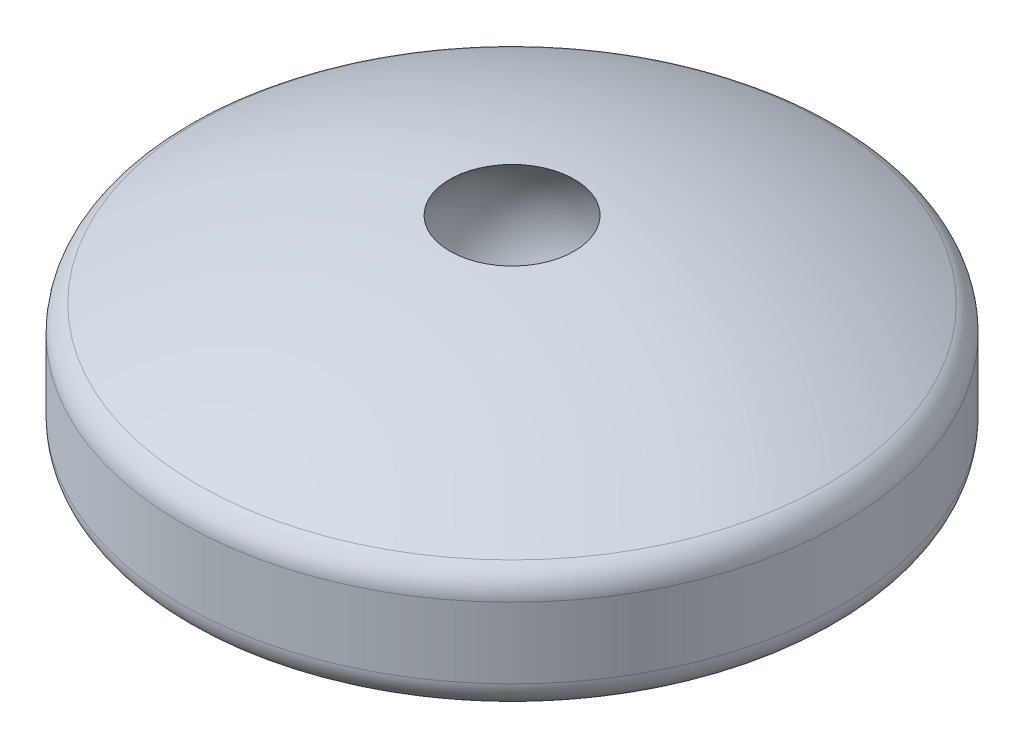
ISO-10303-21;
HEADER;
FILE_DESCRIPTION(('STEP AP214'),'2;1');
FILE_NAME('part.step','',(''),(''),'','','');
FILE_SCHEMA(('AUTOMOTIVE_DESIGN { 1 0 10303 214 1 1 1 1 }'));
ENDSEC;
DATA;
#1=APPLICATION_CONTEXT('core data for automotive mechanical design processes');
#2=APPLICATION_PROTOCOL_DEFINITION('international standard','automotive_design',2000,#1);
#3=PRODUCT_CONTEXT('',#1,'mechanical');
#4=PRODUCT('Part','Part','',(#3));
#5=PRODUCT_RELATED_PRODUCT_CATEGORY('part','',(#4));
#6=PRODUCT_DEFINITION_FORMATION('','',#4);
#7=PRODUCT_DEFINITION_CONTEXT('part definition',#1,'design');
#8=PRODUCT_DEFINITION('design','',#6,#7);
#9=PRODUCT_DEFINITION_SHAPE('','',#8);
#10=(LENGTH_UNIT() NAMED_UNIT(*) SI_UNIT(.MILLI.,.METRE.));
#11=(NAMED_UNIT(*) PLANE_ANGLE_UNIT() SI_UNIT($,.RADIAN.));
#12=(NAMED_UNIT(*) SI_UNIT($,.STERADIAN.) SOLID_ANGLE_UNIT());
#13=UNCERTAINTY_MEASURE_WITH_UNIT(LENGTH_MEASURE(1.E-05),#10,'distance_accuracy_value','');
#14=(GEOMETRIC_REPRESENTATION_CONTEXT(3) GLOBAL_UNCERTAINTY_ASSIGNED_CONTEXT((#13)) GLOBAL_UNIT_ASSIGNED_CONTEXT((#10,
#11,#12)) REPRESENTATION_CONTEXT('',''));
#15=CARTESIAN_POINT('',(0.,0.,0.));
#16=DIRECTION('',(0.,0.,1.));
#17=DIRECTION('',(1.,0.,0.));
#18=AXIS2_PLACEMENT_3D('',#15,#16,#17);
#19=CARTESIAN_POINT('',(0.,0.,0.));
#20=DIRECTION('',(0.,-1.,0.));
#21=DIRECTION('',(0.,0.,-1.));
#22=AXIS2_PLACEMENT_3D('',#19,#20,#21);
#23=PLANE('',#22);
#24=CARTESIAN_POINT('',(0.,0.,0.));
#25=DIRECTION('',(0.,1.,0.));
#26=DIRECTION('',(0.,0.,1.));
#27=AXIS2_PLACEMENT_3D('',#24,#25,#26);
#28=CIRCLE('',#27,20.5);
#29=CARTESIAN_POINT('',(0.,0.,20.5));
#30=VERTEX_POINT('',#29);
#31=EDGE_CURVE('E10',#30,#30,#28,.T.);
#32=ORIENTED_EDGE('',*,*,#31,.F.);
#33=EDGE_LOOP('',(#32));
#34=FACE_BOUND('',#33,.T.);
#35=ADVANCED_FACE('F28',(#34),#23,.T.);
#36=CARTESIAN_POINT('',(0.,2.,0.));
#37=DIRECTION('',(0.,1.,0.));
#38=DIRECTION('',(0.,0.,1.));
#39=AXIS2_PLACEMENT_3D('',#36,#37,#38);
#40=TOROIDAL_SURFACE('',#39,20.5,2.);
#41=ORIENTED_EDGE('',*,*,#31,.T.);
#42=EDGE_LOOP('',(#41));
#43=FACE_BOUND('',#42,.T.);
#44=CARTESIAN_POINT('',(0.,2.,0.));
#45=DIRECTION('',(0.,1.,0.));
#46=DIRECTION('',(0.,0.,1.));
#47=AXIS2_PLACEMENT_3D('',#44,#45,#46);
#48=CIRCLE('',#47,22.5);
#49=CARTESIAN_POINT('',(0.,2.,22.5));
#50=VERTEX_POINT('',#49);
#51=EDGE_CURVE('E35',#50,#50,#48,.T.);
#52=ORIENTED_EDGE('',*,*,#51,.F.);
#53=EDGE_LOOP('',(#52));
#54=FACE_BOUND('',#53,.T.);
#55=ADVANCED_FACE('F66',(#43,#54),#40,.T.);
#56=CARTESIAN_POINT('',(0.,0.,0.));
#57=DIRECTION('',(0.,1.,0.));
#58=DIRECTION('',(0.,0.,1.));
#59=AXIS2_PLACEMENT_3D('',#56,#57,#58);
#60=CYLINDRICAL_SURFACE('',#59,22.5);
#61=ORIENTED_EDGE('',*,*,#51,.T.);
#62=EDGE_LOOP('',(#61));
#63=FACE_BOUND('',#62,.T.);
#64=CARTESIAN_POINT('',(0.,6.82447385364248,0.));
#65=DIRECTION('',(0.,1.,0.));
#66=DIRECTION('',(0.,0.,1.));
#67=AXIS2_PLACEMENT_3D('',#64,#65,#66);
#68=CIRCLE('',#67,22.5);
#69=CARTESIAN_POINT('',(0.,6.82447385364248,22.5));
#70=VERTEX_POINT('',#69);
#71=EDGE_CURVE('E39',#70,#70,#68,.T.);
#72=ORIENTED_EDGE('',*,*,#71,.F.);
#73=EDGE_LOOP('',(#72));
#74=FACE_BOUND('',#73,.T.);
#75=ADVANCED_FACE('F62',(#63,#74),#60,.T.);
#76=CARTESIAN_POINT('',(0.,6.82447385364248,0.));
#77=DIRECTION('',(0.,1.,0.));
#78=DIRECTION('',(0.,0.,1.));
#79=AXIS2_PLACEMENT_3D('',#76,#77,#78);
#80=TOROIDAL_SURFACE('',#79,20.5,2.);
#81=ORIENTED_EDGE('',*,*,#71,.T.);
#82=EDGE_LOOP('',(#81));
#83=FACE_BOUND('',#82,.T.);
#84=CARTESIAN_POINT('',(0.,8.58479681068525,0.));
#85=DIRECTION('',(0.,1.,0.));
#86=DIRECTION('',(0.,0.,1.));
#87=AXIS2_PLACEMENT_3D('',#84,#85,#86);
#88=CIRCLE('',#87,21.4493487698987);
#89=CARTESIAN_POINT('',(21.4493487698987,8.58479681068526,0.));
#90=VERTEX_POINT('',#89);
#91=EDGE_CURVE('E44',#90,#90,#88,.T.);
#92=ORIENTED_EDGE('',*,*,#91,.F.);
#93=EDGE_LOOP('',(#92));
#94=FACE_BOUND('',#93,.T.);
#95=ADVANCED_FACE('F55',(#83,#94),#80,.T.);
#96=CARTESIAN_POINT('',(0.,-31.1875,0.));
#97=DIRECTION('',(0.,1.,0.));
#98=DIRECTION('',(1.,0.,0.));
#99=AXIS2_PLACEMENT_3D('',#96,#97,#98);
#100=SPHERICAL_SURFACE('',#99,45.1875);
#101=CARTESIAN_POINT('',(0.,13.7996943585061,0.));
#102=DIRECTION('',(0.,1.,0.));
#103=DIRECTION('',(-1.,0.,0.));
#104=AXIS2_PLACEMENT_3D('',#101,#102,#103);
#105=CIRCLE('',#104,4.25000000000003);
#106=CARTESIAN_POINT('',(4.25000000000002,13.7996943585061,0.));
#107=VERTEX_POINT('',#106);
#108=EDGE_CURVE('E31',#107,#107,#105,.T.);
#109=CARTESIAN_POINT('',(4.25000000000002,13.7996943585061,0.));
#110=CARTESIAN_POINT('',(4.4376351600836,13.7819682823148,0.));
#111=CARTESIAN_POINT('',(4.62515940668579,13.763068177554,0.));
#112=CARTESIAN_POINT('',(4.99995674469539,13.7229231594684,0.));
#113=CARTESIAN_POINT('',(5.18722983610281,13.7016782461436,0.));
#114=CARTESIAN_POINT('',(5.56149553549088,13.656846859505,0.));
#115=CARTESIAN_POINT('',(5.74848814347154,13.6332603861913,0.));
#116=CARTESIAN_POINT('',(6.12216360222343,13.5837495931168,0.));
#117=CARTESIAN_POINT('',(6.30884645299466,13.557825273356,0.));
#118=CARTESIAN_POINT('',(6.68187316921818,13.503642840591,0.));
#119=CARTESIAN_POINT('',(6.86821703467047,13.4753847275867,0.));
#120=CARTESIAN_POINT('',(7.24053660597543,13.4165391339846,0.));
#121=CARTESIAN_POINT('',(7.4265123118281,13.3859516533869,0.));
#122=CARTESIAN_POINT('',(7.79806644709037,13.322452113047,0.));
#123=CARTESIAN_POINT('',(7.98364487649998,13.2895400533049,0.));
#124=CARTESIAN_POINT('',(8.35437540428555,13.2213965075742,0.));
#125=CARTESIAN_POINT('',(8.53952750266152,13.1861650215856,0.));
#126=CARTESIAN_POINT('',(8.9093763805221,13.1133881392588,0.));
#127=CARTESIAN_POINT('',(9.09407316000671,13.0758427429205,0.));
#128=CARTESIAN_POINT('',(9.46298248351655,12.9984439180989,0.));
#129=CARTESIAN_POINT('',(9.64719502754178,12.9585904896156,0.));
#130=CARTESIAN_POINT('',(10.0151070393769,12.8765818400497,0.));
#131=CARTESIAN_POINT('',(10.1988065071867,12.8344266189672,0.));
#132=CARTESIAN_POINT('',(10.5656636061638,12.7478209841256,0.));
#133=CARTESIAN_POINT('',(10.748821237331,12.7033705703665,0.));
#134=CARTESIAN_POINT('',(11.1145659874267,12.6121815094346,0.));
#135=CARTESIAN_POINT('',(11.2971531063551,12.5654428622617,0.));
#136=CARTESIAN_POINT('',(11.6617282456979,12.4696846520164,0.));
#137=CARTESIAN_POINT('',(11.8437162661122,12.420665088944,0.));
#138=CARTESIAN_POINT('',(12.2070647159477,12.3203527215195,0.));
#139=CARTESIAN_POINT('',(12.3884251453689,12.2690599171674,0.));
#140=CARTESIAN_POINT('',(12.7504900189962,12.1642090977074,0.));
#141=CARTESIAN_POINT('',(12.9311944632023,12.1106510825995,0.));
#142=CARTESIAN_POINT('',(13.2919190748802,12.0012782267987,0.));
#143=CARTESIAN_POINT('',(13.4719392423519,11.9454633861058,0.));
#144=CARTESIAN_POINT('',(13.8312671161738,11.8315856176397,0.));
#145=CARTESIAN_POINT('',(14.0105748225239,11.7735226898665,0.));
#146=CARTESIAN_POINT('',(14.3684497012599,11.6551578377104,0.));
#147=CARTESIAN_POINT('',(14.5470168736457,11.5948559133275,0.));
#148=CARTESIAN_POINT('',(14.90338272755,11.4720225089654,0.));
#149=CARTESIAN_POINT('',(15.0811814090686,11.4094910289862,0.));
#150=CARTESIAN_POINT('',(15.4359824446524,11.2822083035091,0.));
#151=CARTESIAN_POINT('',(15.6129847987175,11.2174570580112,0.));
#152=CARTESIAN_POINT('',(15.9661654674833,11.0857449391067,0.));
#153=CARTESIAN_POINT('',(16.142343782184,11.0187840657,0.));
#154=CARTESIAN_POINT('',(16.4938487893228,10.8826631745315,0.));
#155=CARTESIAN_POINT('',(16.669175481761,10.8135031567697,0.));
#156=CARTESIAN_POINT('',(17.0189497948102,10.6729948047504,0.));
#157=CARTESIAN_POINT('',(17.1933974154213,10.6016464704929,0.));
#158=CARTESIAN_POINT('',(17.5413862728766,10.4567726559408,0.));
#159=CARTESIAN_POINT('',(17.7149275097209,10.3832471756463,0.));
#160=CARTESIAN_POINT('',(18.0610764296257,10.2340305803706,0.));
#161=CARTESIAN_POINT('',(18.2336841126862,10.1583394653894,0.));
#162=CARTESIAN_POINT('',(18.5779389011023,10.0048034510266,0.));
#163=CARTESIAN_POINT('',(18.749586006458,9.92695855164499,0.));
#164=CARTESIAN_POINT('',(19.0918927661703,9.76912715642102,0.));
#165=CARTESIAN_POINT('',(19.262552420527,9.68914066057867,0.));
#166=CARTESIAN_POINT('',(19.6028575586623,9.52703859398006,0.));
#167=CARTESIAN_POINT('',(19.772503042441,9.44492302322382,0.));
#168=CARTESIAN_POINT('',(20.1107532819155,9.27857566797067,0.));
#169=CARTESIAN_POINT('',(20.2793580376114,9.19434388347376,0.));
#170=CARTESIAN_POINT('',(20.6155004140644,9.02377726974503,0.));
#171=CARTESIAN_POINT('',(20.7830380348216,8.93744244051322,0.));
#172=CARTESIAN_POINT('',(21.1170199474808,8.76268332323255,0.));
#173=CARTESIAN_POINT('',(21.2834642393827,8.6742590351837,0.));
#174=CARTESIAN_POINT('',(21.4493487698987,8.58479681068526,0.));
#175=B_SPLINE_CURVE_WITH_KNOTS('',3,(#109,#110,#111,#112,#113,#114,#115,#116,#117,#118,#119,
#120,#121,#122,#123,#124,#125,#126,#127,#128,#129,#130,#131,#132,#133,#134,#135,#136,#137,#138,
#139,#140,#141,#142,#143,#144,#145,#146,#147,#148,#149,#150,#151,#152,#153,#154,#155,#156,#157,
#158,#159,#160,#161,#162,#163,#164,#165,#166,#167,#168,#169,#170,#171,#172,#173,#174),
.UNSPECIFIED.,.F.,.F.,(4,2,2,2,2,2,2,2,2,2,2,2,2,2,2,2,2,2,2,2,2,2,2,2,2,2,2,2,2,2,2,2,4),(0.,
0.565408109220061,1.13081621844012,1.69622432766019,2.26163243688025,2.82704054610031,
3.39244865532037,3.95785676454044,4.5232648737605,5.08867298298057,5.65408109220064,
6.2194892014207,6.78489731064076,7.35030541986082,7.91571352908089,8.48112163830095,
9.04652974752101,9.61193785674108,10.1773459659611,10.7427540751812,11.3081621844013,
11.8735702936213,12.4389784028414,13.0043865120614,13.5697946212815,14.1352027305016,
14.7006108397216,15.2660189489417,15.8314270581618,16.3968351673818,16.9622432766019,
17.527651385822,18.093059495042),.UNSPECIFIED.);
#176=EDGE_CURVE('BSEAM53',#107,#90,#175,.T.);
#177=ORIENTED_EDGE('',*,*,#108,.F.);
#178=ORIENTED_EDGE('',*,*,#91,.T.);
#179=ORIENTED_EDGE('',*,*,#176,.T.);
#180=ORIENTED_EDGE('',*,*,#176,.F.);
#181=EDGE_LOOP('',(#177,#179,#178,#180));
#182=FACE_BOUND('',#181,.T.);
#183=ADVANCED_FACE('F53',(#182),#100,.T.);
#184=CARTESIAN_POINT('',(0.,8.88161546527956,0.));
#185=DIRECTION('',(0.,-1.,0.));
#186=DIRECTION('',(0.,0.,1.));
#187=AXIS2_PLACEMENT_3D('',#184,#185,#186);
#188=SPHERICAL_SURFACE('',#187,6.5);
#189=ORIENTED_EDGE('',*,*,#108,.T.);
#190=EDGE_LOOP('',(#189));
#191=FACE_BOUND('',#190,.T.);
#192=ADVANCED_FACE('F51',(#191),#188,.F.);
#193=CLOSED_SHELL('',(#35,#55,#75,#95,#183,#192));
#194=MANIFOLD_SOLID_BREP('B2',#193);
#195=ADVANCED_BREP_SHAPE_REPRESENTATION('',(#18,#194),#14);
#196=SHAPE_DEFINITION_REPRESENTATION(#9,#195);
ENDSEC;
END-ISO-10303-21;
